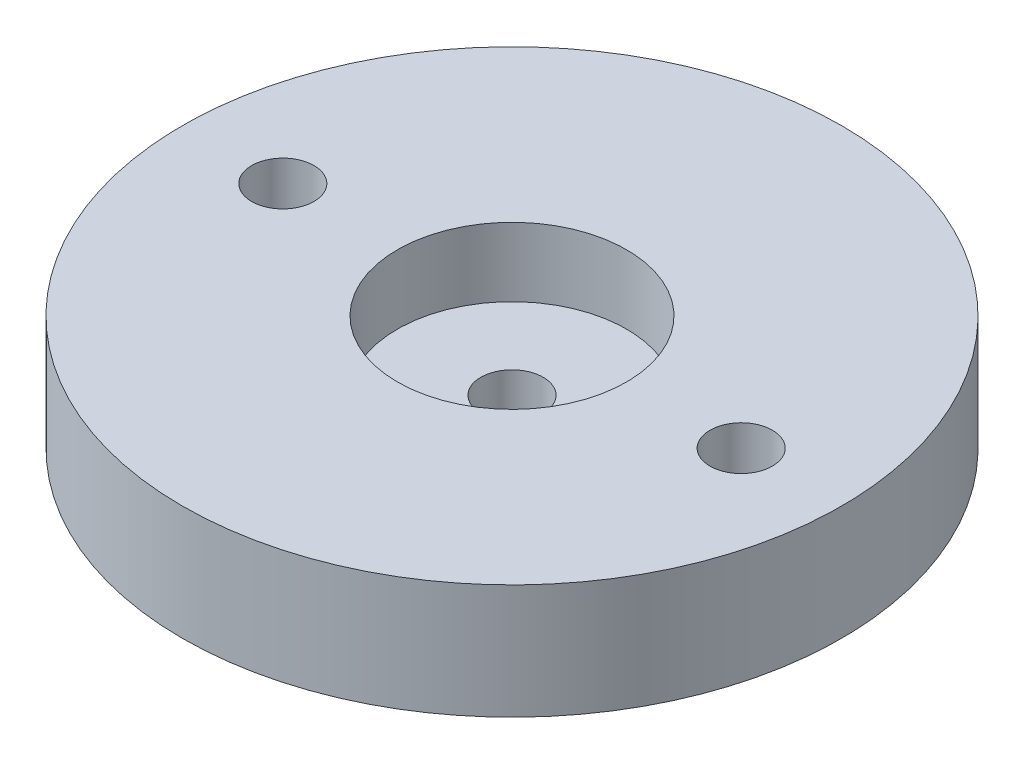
from build123d import *

# Parameters (mm, degrees)
SKETCH1_R           = 18.2626
SKETCH1_R_2         = 1.7272
BOSS_EXTRUDE1_DEPTH = 6.35
SKETCH2_R           = 6.35
CUT_EXTRUDE1_DEPTH  = 3.81
SKETCH3_R           = 1.7272
CUT_EXTRUDE2_DEPTH  = 27.596383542


with BuildPart() as part:
    # Sketch1 → Boss-Extrude1 (new body)
    with BuildSketch(Plane(origin=(0, 0, 0), x_dir=(1, 0, 0), z_dir=(0, 1, 0))):
        with Locations(Location((0, 0, 0), (0, 0, 270))):
            Circle(SKETCH1_R)
        with Locations(Location((0, 0, 0), (0, 0, 270))):
            Circle(SKETCH1_R_2, mode=Mode.SUBTRACT)
    extrude(amount=BOSS_EXTRUDE1_DEPTH)

    # Sketch2 → Cut-Extrude1 (cut)
    with BuildSketch(Plane(origin=(0, 6.35, 0), x_dir=(1, 0, 0), z_dir=(0, 1, 0))):
        with Locations(Location((0, 0, 0), (0, 0, 270))):
            Circle(SKETCH2_R)
    extrude(amount=-CUT_EXTRUDE1_DEPTH, mode=Mode.SUBTRACT)

    # Sketch3 → Cut-Extrude2 (cut, through all)
    with BuildSketch(Plane(origin=(0, 0, 0), x_dir=(1, 0, 0), z_dir=(0, 1, 0))):
        with Locations(Location((-12.7, 0, 0), (0, 0, 270))):
            Circle(SKETCH3_R)
        with Locations(Location((12.7, 0, 0), (0, 0, 270))):
            Circle(SKETCH3_R)
    extrude(amount=CUT_EXTRUDE2_DEPTH, mode=Mode.SUBTRACT)


solid = part.part
